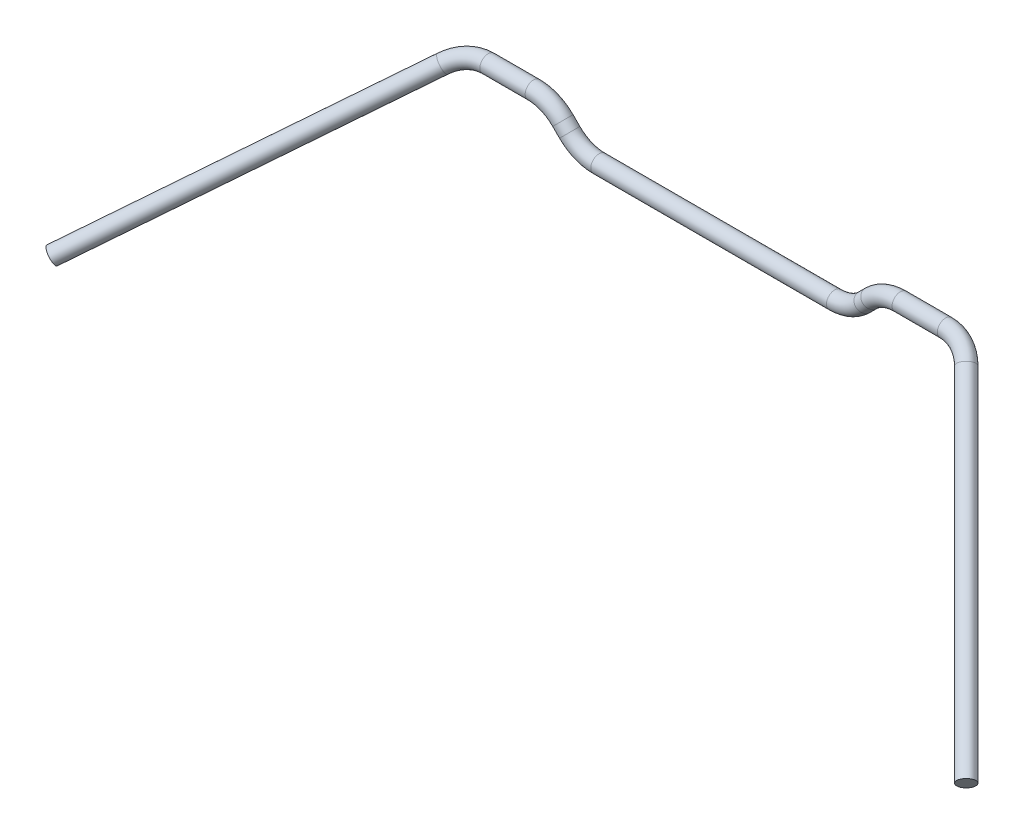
ISO-10303-21;
HEADER;
FILE_DESCRIPTION(('STEP AP214'),'2;1');
FILE_NAME('part.step','',(''),(''),'','','');
FILE_SCHEMA(('AUTOMOTIVE_DESIGN { 1 0 10303 214 1 1 1 1 }'));
ENDSEC;
DATA;
#1=APPLICATION_CONTEXT('core data for automotive mechanical design processes');
#2=APPLICATION_PROTOCOL_DEFINITION('international standard','automotive_design',2000,#1);
#3=PRODUCT_CONTEXT('',#1,'mechanical');
#4=PRODUCT('Part','Part','',(#3));
#5=PRODUCT_RELATED_PRODUCT_CATEGORY('part','',(#4));
#6=PRODUCT_DEFINITION_FORMATION('','',#4);
#7=PRODUCT_DEFINITION_CONTEXT('part definition',#1,'design');
#8=PRODUCT_DEFINITION('design','',#6,#7);
#9=PRODUCT_DEFINITION_SHAPE('','',#8);
#10=(LENGTH_UNIT() NAMED_UNIT(*) SI_UNIT(.MILLI.,.METRE.));
#11=(NAMED_UNIT(*) PLANE_ANGLE_UNIT() SI_UNIT($,.RADIAN.));
#12=(NAMED_UNIT(*) SI_UNIT($,.STERADIAN.) SOLID_ANGLE_UNIT());
#13=UNCERTAINTY_MEASURE_WITH_UNIT(LENGTH_MEASURE(1.E-05),#10,'distance_accuracy_value','');
#14=(GEOMETRIC_REPRESENTATION_CONTEXT(3) GLOBAL_UNCERTAINTY_ASSIGNED_CONTEXT((#13)) GLOBAL_UNIT_ASSIGNED_CONTEXT((#10,
#11,#12)) REPRESENTATION_CONTEXT('',''));
#15=CARTESIAN_POINT('',(0.,0.,0.));
#16=DIRECTION('',(0.,0.,1.));
#17=DIRECTION('',(1.,0.,0.));
#18=AXIS2_PLACEMENT_3D('',#15,#16,#17);
#19=CARTESIAN_POINT('',(12.6003158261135,0.989731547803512,0.600315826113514));
#20=DIRECTION('',(0.606060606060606,-0.515151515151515,0.606060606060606));
#21=DIRECTION('',(0.707106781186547,0.,-0.707106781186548));
#22=AXIS2_PLACEMENT_3D('',#19,#20,#21);
#23=CYLINDRICAL_SURFACE('',#22,0.4);
#24=CARTESIAN_POINT('',(12.6003158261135,0.989731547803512,0.600315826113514));
#25=DIRECTION('',(0.606060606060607,-0.515151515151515,0.606060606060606));
#26=DIRECTION('',(0.606060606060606,-0.194396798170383,-0.771297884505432));
#27=AXIS2_PLACEMENT_3D('',#24,#25,#26);
#28=CIRCLE('',#27,0.4);
#29=CARTESIAN_POINT('',(12.9184832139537,1.14673722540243,0.415603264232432));
#30=VERTEX_POINT('',#29);
#31=EDGE_CURVE('E34',#30,#30,#28,.T.);
#32=ORIENTED_EDGE('',*,*,#31,.T.);
#33=EDGE_LOOP('',(#32));
#34=FACE_BOUND('',#33,.T.);
#35=CARTESIAN_POINT('',(22.,-7.,10.));
#36=DIRECTION('',(0.606060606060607,-0.515151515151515,0.606060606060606));
#37=DIRECTION('',(0.606060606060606,-0.194396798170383,-0.771297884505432));
#38=AXIS2_PLACEMENT_3D('',#35,#36,#37);
#39=CIRCLE('',#38,0.4);
#40=CARTESIAN_POINT('',(22.2424242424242,-7.07775871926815,9.69148084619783));
#41=VERTEX_POINT('',#40);
#42=EDGE_CURVE('E10',#41,#41,#39,.T.);
#43=ORIENTED_EDGE('',*,*,#42,.F.);
#44=EDGE_LOOP('',(#43));
#45=FACE_BOUND('',#44,.T.);
#46=ADVANCED_FACE('F28',(#34,#45),#23,.T.);
#47=CARTESIAN_POINT('',(11.0094788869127,0.204703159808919,1.52387863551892));
#48=DIRECTION('',(0.,-0.761939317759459,-0.647648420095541));
#49=DIRECTION('',(0.,0.647648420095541,-0.761939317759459));
#50=AXIS2_PLACEMENT_3D('',#47,#48,#49);
#51=TOROIDAL_SURFACE('',#50,2.,0.4);
#52=CARTESIAN_POINT('',(11.0094788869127,1.5,0.));
#53=DIRECTION('',(1.,0.,0.));
#54=DIRECTION('',(0.,0.,-1.));
#55=AXIS2_PLACEMENT_3D('',#52,#53,#54);
#56=CIRCLE('',#55,0.4);
#57=CARTESIAN_POINT('',(11.0094788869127,1.75905936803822,-0.304775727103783));
#58=VERTEX_POINT('',#57);
#59=EDGE_CURVE('E38',#58,#58,#56,.T.);
#60=CARTESIAN_POINT('',(11.0094788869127,0.204703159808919,1.52387863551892));
#61=DIRECTION('',(0.,-0.761939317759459,-0.647648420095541));
#62=DIRECTION('',(0.,0.647648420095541,-0.761939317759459));
#63=AXIS2_PLACEMENT_3D('',#60,#61,#62);
#64=CIRCLE('',#63,2.4);
#65=EDGE_CURVE('',#58,#30,#64,.T.);
#66=ORIENTED_EDGE('',*,*,#59,.T.);
#67=ORIENTED_EDGE('',*,*,#31,.F.);
#68=ORIENTED_EDGE('',*,*,#65,.T.);
#69=ORIENTED_EDGE('',*,*,#65,.F.);
#70=EDGE_LOOP('',(#66,#68,#67,#69));
#71=FACE_BOUND('',#70,.T.);
#72=ADVANCED_FACE('F123',(#71),#51,.T.);
#73=CARTESIAN_POINT('',(8.82842712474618,1.5,0.));
#74=DIRECTION('',(1.,0.,0.));
#75=DIRECTION('',(0.,0.,-1.));
#76=AXIS2_PLACEMENT_3D('',#73,#74,#75);
#77=CYLINDRICAL_SURFACE('',#76,0.4);
#78=CARTESIAN_POINT('',(8.82842712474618,1.5,0.));
#79=DIRECTION('',(1.,0.,0.));
#80=DIRECTION('',(0.,0.,-1.));
#81=AXIS2_PLACEMENT_3D('',#78,#79,#80);
#82=CIRCLE('',#81,0.4);
#83=CARTESIAN_POINT('',(8.82842712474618,1.9,0.));
#84=VERTEX_POINT('',#83);
#85=EDGE_CURVE('E42',#84,#84,#82,.T.);
#86=ORIENTED_EDGE('',*,*,#85,.T.);
#87=EDGE_LOOP('',(#86));
#88=FACE_BOUND('',#87,.T.);
#89=ORIENTED_EDGE('',*,*,#59,.F.);
#90=EDGE_LOOP('',(#89));
#91=FACE_BOUND('',#90,.T.);
#92=ADVANCED_FACE('F127',(#88,#91),#77,.T.);
#93=CARTESIAN_POINT('',(8.82842712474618,-0.5,0.));
#94=DIRECTION('',(0.,0.,-1.));
#95=DIRECTION('',(0.,1.,0.));
#96=AXIS2_PLACEMENT_3D('',#93,#94,#95);
#97=TOROIDAL_SURFACE('',#96,2.,0.4);
#98=CARTESIAN_POINT('',(7.41421356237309,0.914213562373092,0.));
#99=DIRECTION('',(0.707106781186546,0.707106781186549,0.));
#100=DIRECTION('',(0.,0.,-1.));
#101=AXIS2_PLACEMENT_3D('',#98,#99,#100);
#102=CIRCLE('',#101,0.4);
#103=CARTESIAN_POINT('',(7.13137084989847,1.19705627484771,0.));
#104=VERTEX_POINT('',#103);
#105=EDGE_CURVE('E47',#104,#104,#102,.T.);
#106=CARTESIAN_POINT('',(8.82842712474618,-0.5,0.));
#107=DIRECTION('',(0.,0.,-1.));
#108=DIRECTION('',(0.,1.,0.));
#109=AXIS2_PLACEMENT_3D('',#106,#107,#108);
#110=CIRCLE('',#109,2.4);
#111=EDGE_CURVE('',#104,#84,#110,.T.);
#112=ORIENTED_EDGE('',*,*,#105,.T.);
#113=ORIENTED_EDGE('',*,*,#85,.F.);
#114=ORIENTED_EDGE('',*,*,#111,.T.);
#115=ORIENTED_EDGE('',*,*,#111,.F.);
#116=EDGE_LOOP('',(#112,#114,#113,#115));
#117=FACE_BOUND('',#116,.T.);
#118=ADVANCED_FACE('F133',(#117),#97,.T.);
#119=CARTESIAN_POINT('',(7.0857864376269,0.585786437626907,0.));
#120=DIRECTION('',(0.707106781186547,0.707106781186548,0.));
#121=DIRECTION('',(-0.707106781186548,0.707106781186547,0.));
#122=AXIS2_PLACEMENT_3D('',#119,#120,#121);
#123=CYLINDRICAL_SURFACE('',#122,0.4);
#124=CARTESIAN_POINT('',(7.0857864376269,0.585786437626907,0.));
#125=DIRECTION('',(0.707106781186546,0.707106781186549,0.));
#126=DIRECTION('',(0.,0.,-1.));
#127=AXIS2_PLACEMENT_3D('',#124,#125,#126);
#128=CIRCLE('',#127,0.4);
#129=CARTESIAN_POINT('',(7.36862915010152,0.302943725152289,0.));
#130=VERTEX_POINT('',#129);
#131=EDGE_CURVE('E50',#130,#130,#128,.T.);
#132=ORIENTED_EDGE('',*,*,#131,.T.);
#133=EDGE_LOOP('',(#132));
#134=FACE_BOUND('',#133,.T.);
#135=ORIENTED_EDGE('',*,*,#105,.F.);
#136=EDGE_LOOP('',(#135));
#137=FACE_BOUND('',#136,.T.);
#138=ADVANCED_FACE('F140',(#134,#137),#123,.T.);
#139=CARTESIAN_POINT('',(5.67157287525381,2.,0.));
#140=DIRECTION('',(0.,0.,1.));
#141=DIRECTION('',(1.,0.,0.));
#142=AXIS2_PLACEMENT_3D('',#139,#140,#141);
#143=TOROIDAL_SURFACE('',#142,2.,0.4);
#144=CARTESIAN_POINT('',(5.67157287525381,0.,0.));
#145=DIRECTION('',(1.,0.,0.));
#146=DIRECTION('',(0.,0.,-1.));
#147=AXIS2_PLACEMENT_3D('',#144,#145,#146);
#148=CIRCLE('',#147,0.4);
#149=CARTESIAN_POINT('',(5.67157287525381,-0.4,0.));
#150=VERTEX_POINT('',#149);
#151=EDGE_CURVE('E53',#150,#150,#148,.T.);
#152=CARTESIAN_POINT('',(5.67157287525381,2.,0.));
#153=DIRECTION('',(0.,0.,1.));
#154=DIRECTION('',(1.,0.,0.));
#155=AXIS2_PLACEMENT_3D('',#152,#153,#154);
#156=CIRCLE('',#155,2.4);
#157=EDGE_CURVE('',#150,#130,#156,.T.);
#158=ORIENTED_EDGE('',*,*,#151,.T.);
#159=ORIENTED_EDGE('',*,*,#131,.F.);
#160=ORIENTED_EDGE('',*,*,#157,.T.);
#161=ORIENTED_EDGE('',*,*,#157,.F.);
#162=EDGE_LOOP('',(#158,#160,#159,#161));
#163=FACE_BOUND('',#162,.T.);
#164=ADVANCED_FACE('F144',(#163),#143,.T.);
#165=CARTESIAN_POINT('',(5.67157287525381,0.,0.));
#166=DIRECTION('',(-1.,0.,0.));
#167=DIRECTION('',(0.,0.,1.));
#168=AXIS2_PLACEMENT_3D('',#165,#166,#167);
#169=CYLINDRICAL_SURFACE('',#168,0.4);
#170=ORIENTED_EDGE('',*,*,#151,.F.);
#171=EDGE_LOOP('',(#170));
#172=FACE_BOUND('',#171,.T.);
#173=CARTESIAN_POINT('',(-5.67157287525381,0.,0.));
#174=DIRECTION('',(1.,0.,0.));
#175=DIRECTION('',(0.,0.,-1.));
#176=AXIS2_PLACEMENT_3D('',#173,#174,#175);
#177=CIRCLE('',#176,0.4);
#178=CARTESIAN_POINT('',(-5.67157287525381,-0.4,0.));
#179=VERTEX_POINT('',#178);
#180=EDGE_CURVE('E74',#179,#179,#177,.T.);
#181=ORIENTED_EDGE('',*,*,#180,.T.);
#182=EDGE_LOOP('',(#181));
#183=FACE_BOUND('',#182,.T.);
#184=ADVANCED_FACE('F78',(#172,#183),#169,.T.);
#185=CARTESIAN_POINT('',(22.,-7.,10.));
#186=DIRECTION('',(0.606060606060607,-0.515151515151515,0.606060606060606));
#187=DIRECTION('',(0.606060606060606,-0.194396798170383,-0.771297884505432));
#188=AXIS2_PLACEMENT_3D('',#185,#186,#187);
#189=PLANE('',#188);
#190=ORIENTED_EDGE('',*,*,#42,.T.);
#191=EDGE_LOOP('',(#190));
#192=FACE_BOUND('',#191,.T.);
#193=ADVANCED_FACE('F114',(#192),#189,.T.);
#194=CARTESIAN_POINT('',(-12.6003158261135,0.989731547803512,0.600315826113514));
#195=DIRECTION('',(-0.606060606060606,-0.515151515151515,0.606060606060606));
#196=DIRECTION('',(0.707106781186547,0.,0.707106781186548));
#197=AXIS2_PLACEMENT_3D('',#194,#195,#196);
#198=CYLINDRICAL_SURFACE('',#197,0.4);
#199=CARTESIAN_POINT('',(-12.6003158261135,0.989731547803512,0.600315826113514));
#200=DIRECTION('',(0.606060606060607,0.515151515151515,-0.606060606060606));
#201=DIRECTION('',(-0.606060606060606,-0.194396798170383,-0.771297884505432));
#202=AXIS2_PLACEMENT_3D('',#199,#200,#201);
#203=CIRCLE('',#202,0.4);
#204=CARTESIAN_POINT('',(-12.9184832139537,1.14673722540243,0.415603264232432));
#205=VERTEX_POINT('',#204);
#206=EDGE_CURVE('E59',#205,#205,#203,.T.);
#207=ORIENTED_EDGE('',*,*,#206,.F.);
#208=EDGE_LOOP('',(#207));
#209=FACE_BOUND('',#208,.T.);
#210=CARTESIAN_POINT('',(-22.,-7.,10.));
#211=DIRECTION('',(0.606060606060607,0.515151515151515,-0.606060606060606));
#212=DIRECTION('',(-0.606060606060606,-0.194396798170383,-0.771297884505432));
#213=AXIS2_PLACEMENT_3D('',#210,#211,#212);
#214=CIRCLE('',#213,0.4);
#215=CARTESIAN_POINT('',(-22.2424242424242,-7.07775871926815,9.69148084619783));
#216=VERTEX_POINT('',#215);
#217=EDGE_CURVE('E56',#216,#216,#214,.T.);
#218=ORIENTED_EDGE('',*,*,#217,.T.);
#219=EDGE_LOOP('',(#218));
#220=FACE_BOUND('',#219,.T.);
#221=ADVANCED_FACE('F108',(#209,#220),#198,.T.);
#222=CARTESIAN_POINT('',(-11.0094788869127,0.204703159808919,1.52387863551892));
#223=DIRECTION('',(0.,0.761939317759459,0.647648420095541));
#224=DIRECTION('',(0.,-0.647648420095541,0.761939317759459));
#225=AXIS2_PLACEMENT_3D('',#222,#223,#224);
#226=TOROIDAL_SURFACE('',#225,2.,0.4);
#227=CARTESIAN_POINT('',(-11.0094788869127,1.5,0.));
#228=DIRECTION('',(1.,0.,0.));
#229=DIRECTION('',(0.,0.,-1.));
#230=AXIS2_PLACEMENT_3D('',#227,#228,#229);
#231=CIRCLE('',#230,0.4);
#232=CARTESIAN_POINT('',(-11.0094788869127,1.75905936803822,-0.304775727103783));
#233=VERTEX_POINT('',#232);
#234=EDGE_CURVE('E62',#233,#233,#231,.T.);
#235=CARTESIAN_POINT('',(-11.0094788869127,0.204703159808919,1.52387863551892));
#236=DIRECTION('',(0.,0.761939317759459,0.647648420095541));
#237=DIRECTION('',(0.,-0.647648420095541,0.761939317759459));
#238=AXIS2_PLACEMENT_3D('',#235,#236,#237);
#239=CIRCLE('',#238,2.4);
#240=EDGE_CURVE('',#233,#205,#239,.T.);
#241=ORIENTED_EDGE('',*,*,#234,.F.);
#242=ORIENTED_EDGE('',*,*,#206,.T.);
#243=ORIENTED_EDGE('',*,*,#240,.T.);
#244=ORIENTED_EDGE('',*,*,#240,.F.);
#245=EDGE_LOOP('',(#241,#243,#242,#244));
#246=FACE_BOUND('',#245,.T.);
#247=ADVANCED_FACE('F102',(#246),#226,.T.);
#248=CARTESIAN_POINT('',(-8.82842712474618,1.5,0.));
#249=DIRECTION('',(-1.,0.,0.));
#250=DIRECTION('',(0.,0.,1.));
#251=AXIS2_PLACEMENT_3D('',#248,#249,#250);
#252=CYLINDRICAL_SURFACE('',#251,0.4);
#253=CARTESIAN_POINT('',(-8.82842712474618,1.5,0.));
#254=DIRECTION('',(1.,0.,0.));
#255=DIRECTION('',(0.,0.,-1.));
#256=AXIS2_PLACEMENT_3D('',#253,#254,#255);
#257=CIRCLE('',#256,0.4);
#258=CARTESIAN_POINT('',(-8.82842712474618,1.9,0.));
#259=VERTEX_POINT('',#258);
#260=EDGE_CURVE('E65',#259,#259,#257,.T.);
#261=ORIENTED_EDGE('',*,*,#260,.F.);
#262=EDGE_LOOP('',(#261));
#263=FACE_BOUND('',#262,.T.);
#264=ORIENTED_EDGE('',*,*,#234,.T.);
#265=EDGE_LOOP('',(#264));
#266=FACE_BOUND('',#265,.T.);
#267=ADVANCED_FACE('F96',(#263,#266),#252,.T.);
#268=CARTESIAN_POINT('',(-8.82842712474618,-0.5,0.));
#269=DIRECTION('',(0.,0.,1.));
#270=DIRECTION('',(0.,-1.,0.));
#271=AXIS2_PLACEMENT_3D('',#268,#269,#270);
#272=TOROIDAL_SURFACE('',#271,2.,0.4);
#273=CARTESIAN_POINT('',(-7.41421356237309,0.914213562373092,0.));
#274=DIRECTION('',(0.707106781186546,-0.707106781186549,0.));
#275=DIRECTION('',(0.,0.,-1.));
#276=AXIS2_PLACEMENT_3D('',#273,#274,#275);
#277=CIRCLE('',#276,0.4);
#278=CARTESIAN_POINT('',(-7.13137084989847,1.19705627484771,0.));
#279=VERTEX_POINT('',#278);
#280=EDGE_CURVE('E68',#279,#279,#277,.T.);
#281=CARTESIAN_POINT('',(-8.82842712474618,-0.5,0.));
#282=DIRECTION('',(0.,0.,1.));
#283=DIRECTION('',(0.,-1.,0.));
#284=AXIS2_PLACEMENT_3D('',#281,#282,#283);
#285=CIRCLE('',#284,2.4);
#286=EDGE_CURVE('',#279,#259,#285,.T.);
#287=ORIENTED_EDGE('',*,*,#280,.F.);
#288=ORIENTED_EDGE('',*,*,#260,.T.);
#289=ORIENTED_EDGE('',*,*,#286,.T.);
#290=ORIENTED_EDGE('',*,*,#286,.F.);
#291=EDGE_LOOP('',(#287,#289,#288,#290));
#292=FACE_BOUND('',#291,.T.);
#293=ADVANCED_FACE('F90',(#292),#272,.T.);
#294=CARTESIAN_POINT('',(-7.0857864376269,0.585786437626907,0.));
#295=DIRECTION('',(-0.707106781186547,0.707106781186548,0.));
#296=DIRECTION('',(-0.707106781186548,-0.707106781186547,0.));
#297=AXIS2_PLACEMENT_3D('',#294,#295,#296);
#298=CYLINDRICAL_SURFACE('',#297,0.4);
#299=CARTESIAN_POINT('',(-7.0857864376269,0.585786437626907,0.));
#300=DIRECTION('',(0.707106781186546,-0.707106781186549,0.));
#301=DIRECTION('',(0.,0.,-1.));
#302=AXIS2_PLACEMENT_3D('',#299,#300,#301);
#303=CIRCLE('',#302,0.4);
#304=CARTESIAN_POINT('',(-7.36862915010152,0.302943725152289,0.));
#305=VERTEX_POINT('',#304);
#306=EDGE_CURVE('E71',#305,#305,#303,.T.);
#307=ORIENTED_EDGE('',*,*,#306,.F.);
#308=EDGE_LOOP('',(#307));
#309=FACE_BOUND('',#308,.T.);
#310=ORIENTED_EDGE('',*,*,#280,.T.);
#311=EDGE_LOOP('',(#310));
#312=FACE_BOUND('',#311,.T.);
#313=ADVANCED_FACE('F84',(#309,#312),#298,.T.);
#314=CARTESIAN_POINT('',(-5.67157287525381,2.,0.));
#315=DIRECTION('',(0.,0.,-1.));
#316=DIRECTION('',(-1.,0.,0.));
#317=AXIS2_PLACEMENT_3D('',#314,#315,#316);
#318=TOROIDAL_SURFACE('',#317,2.,0.4);
#319=CARTESIAN_POINT('',(-5.67157287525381,2.,0.));
#320=DIRECTION('',(0.,0.,-1.));
#321=DIRECTION('',(-1.,0.,0.));
#322=AXIS2_PLACEMENT_3D('',#319,#320,#321);
#323=CIRCLE('',#322,2.4);
#324=EDGE_CURVE('',#179,#305,#323,.T.);
#325=ORIENTED_EDGE('',*,*,#180,.F.);
#326=ORIENTED_EDGE('',*,*,#306,.T.);
#327=ORIENTED_EDGE('',*,*,#324,.T.);
#328=ORIENTED_EDGE('',*,*,#324,.F.);
#329=EDGE_LOOP('',(#325,#327,#326,#328));
#330=FACE_BOUND('',#329,.T.);
#331=ADVANCED_FACE('F80',(#330),#318,.T.);
#332=CARTESIAN_POINT('',(-22.,-7.,10.));
#333=DIRECTION('',(-0.606060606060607,-0.515151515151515,0.606060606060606));
#334=DIRECTION('',(-0.606060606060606,-0.194396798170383,-0.771297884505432));
#335=AXIS2_PLACEMENT_3D('',#332,#333,#334);
#336=PLANE('',#335);
#337=ORIENTED_EDGE('',*,*,#217,.F.);
#338=EDGE_LOOP('',(#337));
#339=FACE_BOUND('',#338,.T.);
#340=ADVANCED_FACE('F83',(#339),#336,.T.);
#341=CLOSED_SHELL('',(#46,#72,#92,#118,#138,#164,#184,#193,#221,#247,#267,#293,#313,#331,#340));
#342=MANIFOLD_SOLID_BREP('B2',#341);
#343=ADVANCED_BREP_SHAPE_REPRESENTATION('',(#18,#342),#14);
#344=SHAPE_DEFINITION_REPRESENTATION(#9,#343);
ENDSEC;
END-ISO-10303-21;
